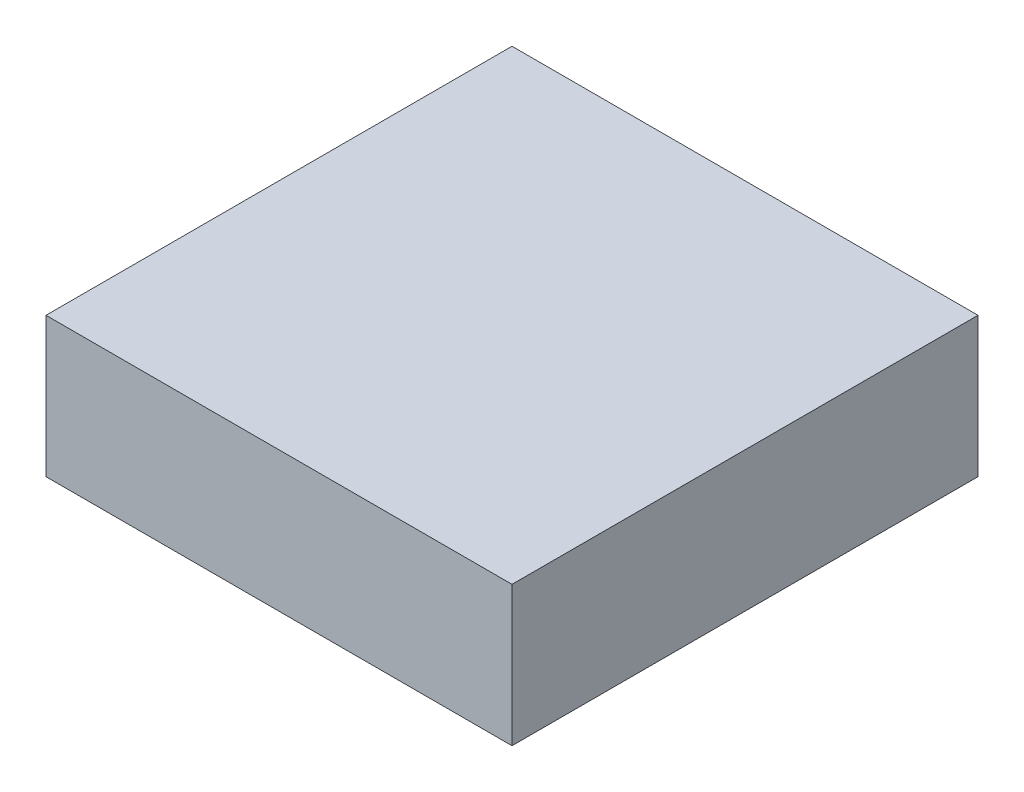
ISO-10303-21;
HEADER;
FILE_DESCRIPTION(('STEP AP214'),'2;1');
FILE_NAME('part.step','',(''),(''),'','','');
FILE_SCHEMA(('AUTOMOTIVE_DESIGN { 1 0 10303 214 1 1 1 1 }'));
ENDSEC;
DATA;
#1=APPLICATION_CONTEXT('core data for automotive mechanical design processes');
#2=APPLICATION_PROTOCOL_DEFINITION('international standard','automotive_design',2000,#1);
#3=PRODUCT_CONTEXT('',#1,'mechanical');
#4=PRODUCT('Part','Part','',(#3));
#5=PRODUCT_RELATED_PRODUCT_CATEGORY('part','',(#4));
#6=PRODUCT_DEFINITION_FORMATION('','',#4);
#7=PRODUCT_DEFINITION_CONTEXT('part definition',#1,'design');
#8=PRODUCT_DEFINITION('design','',#6,#7);
#9=PRODUCT_DEFINITION_SHAPE('','',#8);
#10=(LENGTH_UNIT() NAMED_UNIT(*) SI_UNIT(.MILLI.,.METRE.));
#11=(NAMED_UNIT(*) PLANE_ANGLE_UNIT() SI_UNIT($,.RADIAN.));
#12=(NAMED_UNIT(*) SI_UNIT($,.STERADIAN.) SOLID_ANGLE_UNIT());
#13=UNCERTAINTY_MEASURE_WITH_UNIT(LENGTH_MEASURE(1.E-05),#10,'distance_accuracy_value','');
#14=(GEOMETRIC_REPRESENTATION_CONTEXT(3) GLOBAL_UNCERTAINTY_ASSIGNED_CONTEXT((#13)) GLOBAL_UNIT_ASSIGNED_CONTEXT((#10,
#11,#12)) REPRESENTATION_CONTEXT('',''));
#15=CARTESIAN_POINT('',(0.,0.,0.));
#16=DIRECTION('',(0.,0.,1.));
#17=DIRECTION('',(1.,0.,0.));
#18=AXIS2_PLACEMENT_3D('',#15,#16,#17);
#19=CARTESIAN_POINT('',(-2.5,2.75000000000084,5.));
#20=DIRECTION('',(0.,1.,0.));
#21=DIRECTION('',(0.,0.,1.));
#22=AXIS2_PLACEMENT_3D('',#19,#20,#21);
#23=PLANE('',#22);
#24=DIRECTION('',(1.,0.,0.));
#25=VECTOR('',#24,1.);
#26=CARTESIAN_POINT('',(-2.5,2.75000000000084,3.));
#27=LINE('',#26,#25);
#28=CARTESIAN_POINT('',(-2.5,2.75000000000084,3.));
#29=VERTEX_POINT('',#28);
#30=CARTESIAN_POINT('',(2.5,2.75000000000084,3.));
#31=VERTEX_POINT('',#30);
#32=EDGE_CURVE('E11',#29,#31,#27,.T.);
#33=ORIENTED_EDGE('',*,*,#32,.F.);
#34=DIRECTION('',(0.,0.,-1.));
#35=VECTOR('',#34,1.);
#36=CARTESIAN_POINT('',(-2.5,2.75000000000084,5.));
#37=LINE('',#36,#35);
#38=CARTESIAN_POINT('',(-2.5,2.75000000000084,0.));
#39=VERTEX_POINT('',#38);
#40=EDGE_CURVE('E116',#29,#39,#37,.T.);
#41=ORIENTED_EDGE('',*,*,#40,.T.);
#42=DIRECTION('',(1.,0.,0.));
#43=VECTOR('',#42,1.);
#44=CARTESIAN_POINT('',(-2.5,2.75000000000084,0.));
#45=LINE('',#44,#43);
#46=CARTESIAN_POINT('',(2.5,2.75000000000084,0.));
#47=VERTEX_POINT('',#46);
#48=EDGE_CURVE('E85',#39,#47,#45,.T.);
#49=ORIENTED_EDGE('',*,*,#48,.T.);
#50=DIRECTION('',(0.,0.,-1.));
#51=VECTOR('',#50,1.);
#52=CARTESIAN_POINT('',(2.5,2.75000000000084,5.));
#53=LINE('',#52,#51);
#54=EDGE_CURVE('E112',#31,#47,#53,.T.);
#55=ORIENTED_EDGE('',*,*,#54,.F.);
#56=EDGE_LOOP('',(#33,#41,#49,#55));
#57=FACE_BOUND('',#56,.T.);
#58=ADVANCED_FACE('F32',(#57),#23,.F.);
#59=CARTESIAN_POINT('',(2.5,4.25000000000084,5.));
#60=DIRECTION('',(0.,-1.,0.));
#61=DIRECTION('',(0.,0.,-1.));
#62=AXIS2_PLACEMENT_3D('',#59,#60,#61);
#63=PLANE('',#62);
#64=DIRECTION('',(-1.,0.,0.));
#65=VECTOR('',#64,1.);
#66=CARTESIAN_POINT('',(2.5,4.25000000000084,0.));
#67=LINE('',#66,#65);
#68=CARTESIAN_POINT('',(2.5,4.25000000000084,0.));
#69=VERTEX_POINT('',#68);
#70=CARTESIAN_POINT('',(-2.5,4.25000000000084,0.));
#71=VERTEX_POINT('',#70);
#72=EDGE_CURVE('E83',#69,#71,#67,.T.);
#73=ORIENTED_EDGE('',*,*,#72,.T.);
#74=DIRECTION('',(0.,0.,-1.));
#75=VECTOR('',#74,1.);
#76=CARTESIAN_POINT('',(-2.5,4.25000000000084,5.));
#77=LINE('',#76,#75);
#78=CARTESIAN_POINT('',(-2.5,4.25000000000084,5.));
#79=VERTEX_POINT('',#78);
#80=EDGE_CURVE('E41',#79,#71,#77,.T.);
#81=ORIENTED_EDGE('',*,*,#80,.F.);
#82=DIRECTION('',(-1.,0.,0.));
#83=VECTOR('',#82,1.);
#84=CARTESIAN_POINT('',(2.5,4.25000000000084,5.));
#85=LINE('',#84,#83);
#86=CARTESIAN_POINT('',(2.5,4.25000000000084,5.));
#87=VERTEX_POINT('',#86);
#88=EDGE_CURVE('E104',#87,#79,#85,.T.);
#89=ORIENTED_EDGE('',*,*,#88,.F.);
#90=DIRECTION('',(0.,0.,-1.));
#91=VECTOR('',#90,1.);
#92=CARTESIAN_POINT('',(2.5,4.25000000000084,5.));
#93=LINE('',#92,#91);
#94=EDGE_CURVE('E98',#87,#69,#93,.T.);
#95=ORIENTED_EDGE('',*,*,#94,.T.);
#96=EDGE_LOOP('',(#73,#81,#89,#95));
#97=FACE_BOUND('',#96,.T.);
#98=ADVANCED_FACE('F34',(#97),#63,.F.);
#99=CARTESIAN_POINT('',(-2.5,4.25000000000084,5.));
#100=DIRECTION('',(1.,0.,0.));
#101=DIRECTION('',(0.,1.,0.));
#102=AXIS2_PLACEMENT_3D('',#99,#100,#101);
#103=PLANE('',#102);
#104=DIRECTION('',(0.,-1.,0.));
#105=VECTOR('',#104,1.);
#106=CARTESIAN_POINT('',(-2.5,4.25000000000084,0.));
#107=LINE('',#106,#105);
#108=EDGE_CURVE('E78',#71,#39,#107,.T.);
#109=ORIENTED_EDGE('',*,*,#108,.T.);
#110=ORIENTED_EDGE('',*,*,#40,.F.);
#111=CARTESIAN_POINT('',(-2.5,2.75000000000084,5.));
#112=VERTEX_POINT('',#111);
#113=EDGE_CURVE('E95',#112,#29,#37,.T.);
#114=ORIENTED_EDGE('',*,*,#113,.F.);
#115=DIRECTION('',(0.,-1.,0.));
#116=VECTOR('',#115,1.);
#117=CARTESIAN_POINT('',(-2.5,4.25000000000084,5.));
#118=LINE('',#117,#116);
#119=EDGE_CURVE('E91',#79,#112,#118,.T.);
#120=ORIENTED_EDGE('',*,*,#119,.F.);
#121=ORIENTED_EDGE('',*,*,#80,.T.);
#122=EDGE_LOOP('',(#109,#110,#114,#120,#121));
#123=FACE_BOUND('',#122,.T.);
#124=ADVANCED_FACE('F89',(#123),#103,.F.);
#125=ORIENTED_EDGE('',*,*,#113,.T.);
#126=ORIENTED_EDGE('',*,*,#32,.T.);
#127=CARTESIAN_POINT('',(2.5,2.75000000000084,5.));
#128=VERTEX_POINT('',#127);
#129=EDGE_CURVE('E113',#128,#31,#53,.T.);
#130=ORIENTED_EDGE('',*,*,#129,.F.);
#131=DIRECTION('',(1.,0.,0.));
#132=VECTOR('',#131,1.);
#133=CARTESIAN_POINT('',(-2.5,2.75000000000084,5.));
#134=LINE('',#133,#132);
#135=EDGE_CURVE('E107',#112,#128,#134,.T.);
#136=ORIENTED_EDGE('',*,*,#135,.F.);
#137=EDGE_LOOP('',(#125,#126,#130,#136));
#138=FACE_BOUND('',#137,.T.);
#139=ADVANCED_FACE('F118',(#138),#23,.F.);
#140=CARTESIAN_POINT('',(2.5,2.75000000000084,5.));
#141=DIRECTION('',(-1.,0.,0.));
#142=DIRECTION('',(0.,-1.,0.));
#143=AXIS2_PLACEMENT_3D('',#140,#141,#142);
#144=PLANE('',#143);
#145=DIRECTION('',(0.,1.,0.));
#146=VECTOR('',#145,1.);
#147=CARTESIAN_POINT('',(2.5,2.75000000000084,0.));
#148=LINE('',#147,#146);
#149=EDGE_CURVE('E102',#47,#69,#148,.T.);
#150=ORIENTED_EDGE('',*,*,#149,.T.);
#151=ORIENTED_EDGE('',*,*,#94,.F.);
#152=DIRECTION('',(0.,1.,0.));
#153=VECTOR('',#152,1.);
#154=CARTESIAN_POINT('',(2.5,2.75000000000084,5.));
#155=LINE('',#154,#153);
#156=EDGE_CURVE('E109',#128,#87,#155,.T.);
#157=ORIENTED_EDGE('',*,*,#156,.F.);
#158=ORIENTED_EDGE('',*,*,#129,.T.);
#159=ORIENTED_EDGE('',*,*,#54,.T.);
#160=EDGE_LOOP('',(#150,#151,#157,#158,#159));
#161=FACE_BOUND('',#160,.T.);
#162=ADVANCED_FACE('F123',(#161),#144,.F.);
#163=CARTESIAN_POINT('',(-2.5,4.25000000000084,5.));
#164=DIRECTION('',(0.,0.,1.));
#165=DIRECTION('',(1.,0.,0.));
#166=AXIS2_PLACEMENT_3D('',#163,#164,#165);
#167=PLANE('',#166);
#168=ORIENTED_EDGE('',*,*,#88,.T.);
#169=ORIENTED_EDGE('',*,*,#119,.T.);
#170=ORIENTED_EDGE('',*,*,#135,.T.);
#171=ORIENTED_EDGE('',*,*,#156,.T.);
#172=EDGE_LOOP('',(#168,#169,#170,#171));
#173=FACE_BOUND('',#172,.T.);
#174=ADVANCED_FACE('F121',(#173),#167,.T.);
#175=CARTESIAN_POINT('',(-2.5,4.25000000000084,0.));
#176=DIRECTION('',(0.,0.,1.));
#177=DIRECTION('',(1.,0.,0.));
#178=AXIS2_PLACEMENT_3D('',#175,#176,#177);
#179=PLANE('',#178);
#180=ORIENTED_EDGE('',*,*,#72,.F.);
#181=ORIENTED_EDGE('',*,*,#149,.F.);
#182=ORIENTED_EDGE('',*,*,#48,.F.);
#183=ORIENTED_EDGE('',*,*,#108,.F.);
#184=EDGE_LOOP('',(#180,#181,#182,#183));
#185=FACE_BOUND('',#184,.T.);
#186=ADVANCED_FACE('F80',(#185),#179,.F.);
#187=CLOSED_SHELL('',(#58,#98,#124,#139,#162,#174,#186));
#188=MANIFOLD_SOLID_BREP('B2',#187);
#189=ADVANCED_BREP_SHAPE_REPRESENTATION('',(#18,#188),#14);
#190=SHAPE_DEFINITION_REPRESENTATION(#9,#189);
ENDSEC;
END-ISO-10303-21;
